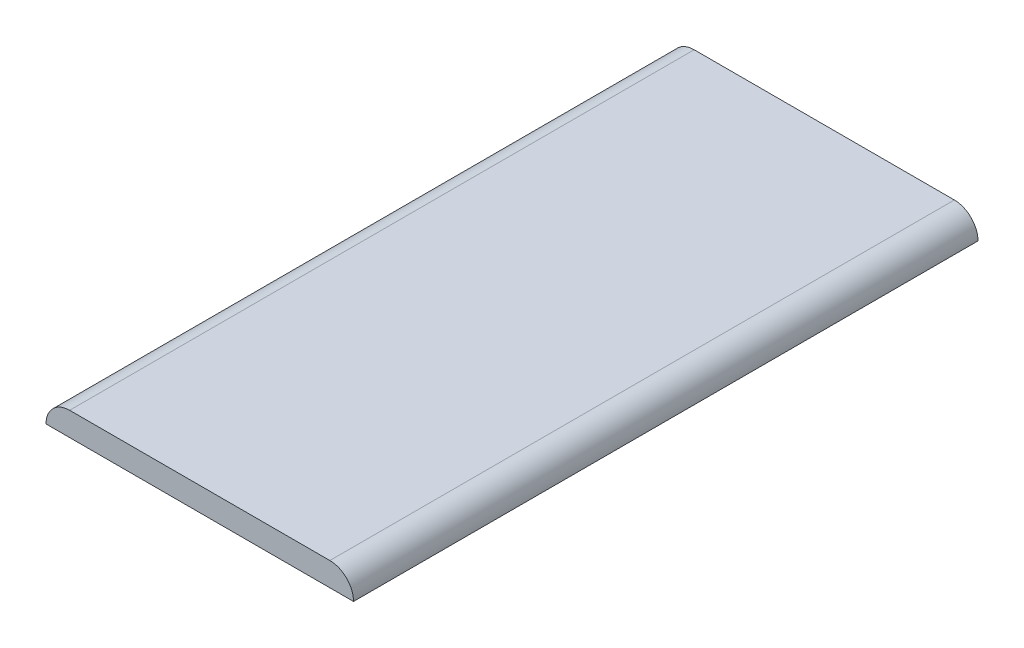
ISO-10303-21;
HEADER;
FILE_DESCRIPTION(('STEP AP214'),'2;1');
FILE_NAME('part.step','',(''),(''),'','','');
FILE_SCHEMA(('AUTOMOTIVE_DESIGN { 1 0 10303 214 1 1 1 1 }'));
ENDSEC;
DATA;
#1=APPLICATION_CONTEXT('core data for automotive mechanical design processes');
#2=APPLICATION_PROTOCOL_DEFINITION('international standard','automotive_design',2000,#1);
#3=PRODUCT_CONTEXT('',#1,'mechanical');
#4=PRODUCT('Part','Part','',(#3));
#5=PRODUCT_RELATED_PRODUCT_CATEGORY('part','',(#4));
#6=PRODUCT_DEFINITION_FORMATION('','',#4);
#7=PRODUCT_DEFINITION_CONTEXT('part definition',#1,'design');
#8=PRODUCT_DEFINITION('design','',#6,#7);
#9=PRODUCT_DEFINITION_SHAPE('','',#8);
#10=(LENGTH_UNIT() NAMED_UNIT(*) SI_UNIT(.MILLI.,.METRE.));
#11=(NAMED_UNIT(*) PLANE_ANGLE_UNIT() SI_UNIT($,.RADIAN.));
#12=(NAMED_UNIT(*) SI_UNIT($,.STERADIAN.) SOLID_ANGLE_UNIT());
#13=UNCERTAINTY_MEASURE_WITH_UNIT(LENGTH_MEASURE(1.E-05),#10,'distance_accuracy_value','');
#14=(GEOMETRIC_REPRESENTATION_CONTEXT(3) GLOBAL_UNCERTAINTY_ASSIGNED_CONTEXT((#13)) GLOBAL_UNIT_ASSIGNED_CONTEXT((#10,
#11,#12)) REPRESENTATION_CONTEXT('',''));
#15=CARTESIAN_POINT('',(0.,0.,0.));
#16=DIRECTION('',(0.,0.,1.));
#17=DIRECTION('',(1.,0.,0.));
#18=AXIS2_PLACEMENT_3D('',#15,#16,#17);
#19=CARTESIAN_POINT('',(0.,0.,132.));
#20=DIRECTION('',(0.,0.,-1.));
#21=DIRECTION('',(-1.,0.,0.));
#22=AXIS2_PLACEMENT_3D('',#19,#20,#21);
#23=PLANE('',#22);
#24=DIRECTION('',(-1.,0.,0.));
#25=VECTOR('',#24,1.);
#26=CARTESIAN_POINT('',(0.,25.,132.));
#27=LINE('',#26,#25);
#28=CARTESIAN_POINT('',(65.,25.,132.));
#29=VERTEX_POINT('',#28);
#30=CARTESIAN_POINT('',(0.,25.,132.));
#31=VERTEX_POINT('',#30);
#32=EDGE_CURVE('E82',#29,#31,#27,.T.);
#33=ORIENTED_EDGE('',*,*,#32,.F.);
#34=CARTESIAN_POINT('',(60.,25.,132.));
#35=DIRECTION('',(0.,0.,-1.));
#36=DIRECTION('',(-1.,0.,0.));
#37=AXIS2_PLACEMENT_3D('',#34,#35,#36);
#38=CIRCLE('',#37,5.);
#39=CARTESIAN_POINT('',(60.,30.,132.));
#40=VERTEX_POINT('',#39);
#41=EDGE_CURVE('E85',#29,#40,#38,.F.);
#42=ORIENTED_EDGE('',*,*,#41,.T.);
#43=DIRECTION('',(-1.,0.,0.));
#44=VECTOR('',#43,1.);
#45=CARTESIAN_POINT('',(0.,30.,132.));
#46=LINE('',#45,#44);
#47=CARTESIAN_POINT('',(4.99999999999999,30.,132.));
#48=VERTEX_POINT('',#47);
#49=EDGE_CURVE('E100',#40,#48,#46,.T.);
#50=ORIENTED_EDGE('',*,*,#49,.T.);
#51=CARTESIAN_POINT('',(4.99999999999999,25.,132.));
#52=DIRECTION('',(0.,0.,-1.));
#53=DIRECTION('',(-1.,0.,0.));
#54=AXIS2_PLACEMENT_3D('',#51,#52,#53);
#55=CIRCLE('',#54,5.);
#56=EDGE_CURVE('E11',#48,#31,#55,.F.);
#57=ORIENTED_EDGE('',*,*,#56,.T.);
#58=EDGE_LOOP('',(#33,#42,#50,#57));
#59=FACE_BOUND('',#58,.T.);
#60=ADVANCED_FACE('F35',(#59),#23,.F.);
#61=CARTESIAN_POINT('',(0.,0.,0.));
#62=DIRECTION('',(0.,0.,-1.));
#63=DIRECTION('',(-1.,0.,0.));
#64=AXIS2_PLACEMENT_3D('',#61,#62,#63);
#65=PLANE('',#64);
#66=CARTESIAN_POINT('',(60.,25.,0.));
#67=DIRECTION('',(0.,0.,-1.));
#68=DIRECTION('',(-1.,0.,0.));
#69=AXIS2_PLACEMENT_3D('',#66,#67,#68);
#70=CIRCLE('',#69,5.);
#71=CARTESIAN_POINT('',(60.,30.,0.));
#72=VERTEX_POINT('',#71);
#73=CARTESIAN_POINT('',(65.,25.,0.));
#74=VERTEX_POINT('',#73);
#75=EDGE_CURVE('E88',#72,#74,#70,.T.);
#76=ORIENTED_EDGE('',*,*,#75,.T.);
#77=DIRECTION('',(1.,0.,0.));
#78=VECTOR('',#77,1.);
#79=CARTESIAN_POINT('',(0.,25.,0.));
#80=LINE('',#79,#78);
#81=CARTESIAN_POINT('',(0.,25.,0.));
#82=VERTEX_POINT('',#81);
#83=EDGE_CURVE('E79',#82,#74,#80,.T.);
#84=ORIENTED_EDGE('',*,*,#83,.F.);
#85=CARTESIAN_POINT('',(4.99999999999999,25.,0.));
#86=DIRECTION('',(0.,0.,-1.));
#87=DIRECTION('',(-1.,0.,0.));
#88=AXIS2_PLACEMENT_3D('',#85,#86,#87);
#89=CIRCLE('',#88,5.);
#90=CARTESIAN_POINT('',(4.99999999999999,30.,0.));
#91=VERTEX_POINT('',#90);
#92=EDGE_CURVE('E57',#82,#91,#89,.T.);
#93=ORIENTED_EDGE('',*,*,#92,.T.);
#94=DIRECTION('',(-1.,0.,0.));
#95=VECTOR('',#94,1.);
#96=CARTESIAN_POINT('',(0.,30.,0.));
#97=LINE('',#96,#95);
#98=EDGE_CURVE('E101',#72,#91,#97,.T.);
#99=ORIENTED_EDGE('',*,*,#98,.F.);
#100=EDGE_LOOP('',(#76,#84,#93,#99));
#101=FACE_BOUND('',#100,.T.);
#102=ADVANCED_FACE('F87',(#101),#65,.T.);
#103=CARTESIAN_POINT('',(0.,30.,132.));
#104=DIRECTION('',(0.,-1.,0.));
#105=DIRECTION('',(0.,0.,-1.));
#106=AXIS2_PLACEMENT_3D('',#103,#104,#105);
#107=PLANE('',#106);
#108=ORIENTED_EDGE('',*,*,#98,.T.);
#109=DIRECTION('',(0.,0.,-1.));
#110=VECTOR('',#109,1.);
#111=CARTESIAN_POINT('',(4.99999999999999,30.,132.));
#112=LINE('',#111,#110);
#113=EDGE_CURVE('E43',#91,#48,#112,.F.);
#114=ORIENTED_EDGE('',*,*,#113,.T.);
#115=ORIENTED_EDGE('',*,*,#49,.F.);
#116=DIRECTION('',(0.,0.,-1.));
#117=VECTOR('',#116,1.);
#118=CARTESIAN_POINT('',(60.,30.,132.));
#119=LINE('',#118,#117);
#120=EDGE_CURVE('E97',#40,#72,#119,.T.);
#121=ORIENTED_EDGE('',*,*,#120,.T.);
#122=EDGE_LOOP('',(#108,#114,#115,#121));
#123=FACE_BOUND('',#122,.T.);
#124=ADVANCED_FACE('F107',(#123),#107,.F.);
#125=CARTESIAN_POINT('',(60.,25.,132.));
#126=DIRECTION('',(0.,0.,-1.));
#127=DIRECTION('',(-1.,0.,0.));
#128=AXIS2_PLACEMENT_3D('',#125,#126,#127);
#129=CYLINDRICAL_SURFACE('',#128,5.);
#130=ORIENTED_EDGE('',*,*,#41,.F.);
#131=DIRECTION('',(0.,0.,-1.));
#132=VECTOR('',#131,1.);
#133=CARTESIAN_POINT('',(65.,25.,132.));
#134=LINE('',#133,#132);
#135=EDGE_CURVE('E94',#74,#29,#134,.F.);
#136=ORIENTED_EDGE('',*,*,#135,.F.);
#137=ORIENTED_EDGE('',*,*,#75,.F.);
#138=ORIENTED_EDGE('',*,*,#120,.F.);
#139=EDGE_LOOP('',(#130,#136,#137,#138));
#140=FACE_BOUND('',#139,.T.);
#141=ADVANCED_FACE('F109',(#140),#129,.T.);
#142=CARTESIAN_POINT('',(4.99999999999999,25.,132.));
#143=DIRECTION('',(0.,0.,-1.));
#144=DIRECTION('',(-1.,0.,0.));
#145=AXIS2_PLACEMENT_3D('',#142,#143,#144);
#146=CYLINDRICAL_SURFACE('',#145,5.);
#147=ORIENTED_EDGE('',*,*,#56,.F.);
#148=ORIENTED_EDGE('',*,*,#113,.F.);
#149=ORIENTED_EDGE('',*,*,#92,.F.);
#150=DIRECTION('',(0.,0.,-1.));
#151=VECTOR('',#150,1.);
#152=CARTESIAN_POINT('',(0.,25.,132.));
#153=LINE('',#152,#151);
#154=EDGE_CURVE('E77',#31,#82,#153,.T.);
#155=ORIENTED_EDGE('',*,*,#154,.F.);
#156=EDGE_LOOP('',(#147,#148,#149,#155));
#157=FACE_BOUND('',#156,.T.);
#158=ADVANCED_FACE('F37',(#157),#146,.T.);
#159=CARTESIAN_POINT('',(0.,25.,0.));
#160=DIRECTION('',(0.,-1.,0.));
#161=DIRECTION('',(0.,0.,-1.));
#162=AXIS2_PLACEMENT_3D('',#159,#160,#161);
#163=PLANE('',#162);
#164=ORIENTED_EDGE('',*,*,#154,.T.);
#165=ORIENTED_EDGE('',*,*,#83,.T.);
#166=ORIENTED_EDGE('',*,*,#135,.T.);
#167=ORIENTED_EDGE('',*,*,#32,.T.);
#168=EDGE_LOOP('',(#164,#165,#166,#167));
#169=FACE_BOUND('',#168,.T.);
#170=ADVANCED_FACE('F78',(#169),#163,.T.);
#171=CLOSED_SHELL('',(#60,#102,#124,#141,#158,#170));
#172=MANIFOLD_SOLID_BREP('B2',#171);
#173=ADVANCED_BREP_SHAPE_REPRESENTATION('',(#18,#172),#14);
#174=SHAPE_DEFINITION_REPRESENTATION(#9,#173);
ENDSEC;
END-ISO-10303-21;
